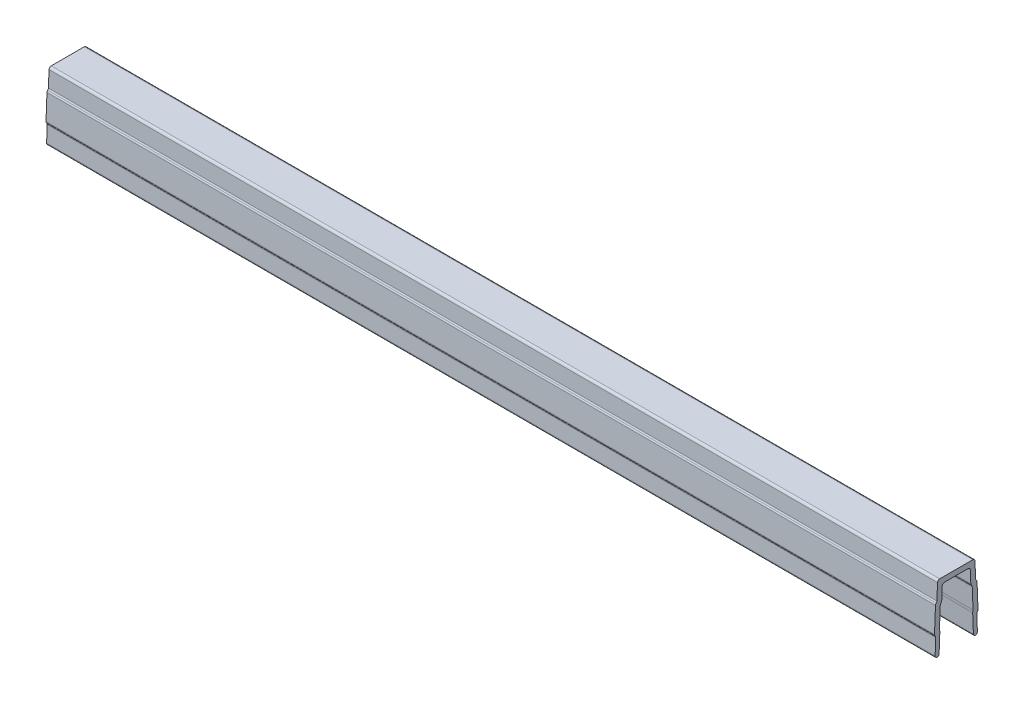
from build123d import *

# Parameters (mm, degrees)
PEITELISTAT_1_6009_PEITELISTA_45_VIHRE_1_DEPTH = 200


with BuildPart() as part:
    # Sketch1 → Peitelistat 1.6009 PEITELISTA 45 VIHRE_1 (new body)
    with BuildSketch(Plane(origin=(0, 0, 0), x_dir=(0, 0, -1), z_dir=(1, 0, 0))):
        with BuildLine():
            Line((-4.811852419, 2.866495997), (-5.025732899, -2.700970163))
            ThreePointArc((-5.025732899, -2.700970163), (-4.99504591, -2.893631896), (-4.892966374, -3.059884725))
            Line((-4.892966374, -3.059884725), (-4.886137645, -3.067259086))
            ThreePointArc((-4.886137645, -3.067259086), (-4.784058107, -3.233511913), (-4.753371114, -3.426173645))
            Line((-4.753371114, -3.426173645), (-4.889408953, -6.967338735))
            ThreePointArc((-4.889408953, -6.967338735), (-4.457015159, -7.434281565), (-3.990072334, -7.001887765))
            Line((-3.990072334, -7.001887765), (-3.825859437, -2.727305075))
            ThreePointArc((-3.825859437, -2.727305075), (-3.834218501, -2.615098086), (-3.867456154, -2.507601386))
            ThreePointArc((-3.867456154, -2.507601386), (-3.900693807, -2.400104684), (-3.909052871, -2.287897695))
            Line((-3.909052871, -2.287897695), (-3.730154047, 2.368970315))
            ThreePointArc((-3.730154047, 2.368970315), (-3.684776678, 2.558709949), (-3.570243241, 2.716641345))
            Line((-3.570243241, 2.716641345), (-3.562868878, 2.723470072))
            ThreePointArc((-3.562868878, 2.723470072), (-3.44833544, 2.88140147), (-3.402958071, 3.071141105))
            Line((-3.402958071, 3.071141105), (-3.29486388, 5.884912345))
            ThreePointArc((-3.29486388, 5.884912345), (-3.14193333, 6.225994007), (-2.795232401, 6.365718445))
            Line((-2.795232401, 6.365718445), (2.533022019, 6.365718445))
            ThreePointArc((2.533022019, 6.365718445), (2.879722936, 6.225993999), (3.032653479, 5.884912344))
            Line((3.032653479, 5.884912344), (3.140747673, 3.071141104))
            ThreePointArc((3.140747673, 3.071141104), (3.186125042, 2.88140147), (3.300658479, 2.723470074))
            Line((3.300658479, 2.723470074), (3.308032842, 2.716641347))
            ThreePointArc((3.308032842, 2.716641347), (3.42256628, 2.558709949), (3.467943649, 2.368970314))
            Line((3.467943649, 2.368970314), (3.646842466, -2.287897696))
            ThreePointArc((3.646842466, -2.287897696), (3.638483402, -2.400104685), (3.605245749, -2.507601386))
            ThreePointArc((3.605245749, -2.507601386), (3.572008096, -2.615098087), (3.563649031, -2.727305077))
            Line((3.563649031, -2.727305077), (3.727861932, -7.001887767))
            ThreePointArc((3.727861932, -7.001887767), (4.194804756, -7.434281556), (4.627198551, -6.967338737))
            Line((4.627198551, -6.967338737), (4.491160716, -3.426173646))
            ThreePointArc((4.491160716, -3.426173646), (4.521847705, -3.233511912), (4.623927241, -3.067259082))
            Line((4.623927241, -3.067259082), (4.630755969, -3.05988472))
            ThreePointArc((4.630755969, -3.05988472), (4.732835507, -2.893631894), (4.763522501, -2.700970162))
            Line((4.763522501, -2.700970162), (4.549642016, 2.866495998))
            ThreePointArc((4.549642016, 2.866495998), (4.504264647, 3.056235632), (4.389731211, 3.214167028))
            Line((4.389731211, 3.214167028), (4.382356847, 3.220995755))
            ThreePointArc((4.382356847, 3.220995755), (4.267823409, 3.378927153), (4.222446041, 3.568666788))
            Line((4.222446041, 3.568666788), (4.087365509, 7.084912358))
            ThreePointArc((4.087365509, 7.084912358), (3.934434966, 7.425994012), (3.587734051, 7.565718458))
            Line((3.587734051, 7.565718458), (-3.849944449, 7.565718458))
            ThreePointArc((-3.849944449, 7.565718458), (-4.196645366, 7.425994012), (-4.349575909, 7.084912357))
            Line((-4.349575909, 7.084912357), (-4.484656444, 3.568666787))
            ThreePointArc((-4.484656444, 3.568666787), (-4.530033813, 3.378927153), (-4.644567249, 3.220995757))
            Line((-4.644567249, 3.220995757), (-4.651941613, 3.21416703))
            ThreePointArc((-4.651941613, 3.21416703), (-4.766475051, 3.056235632), (-4.811852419, 2.866495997))
        make_face()
    extrude(amount=PEITELISTAT_1_6009_PEITELISTA_45_VIHRE_1_DEPTH)


solid = part.part
